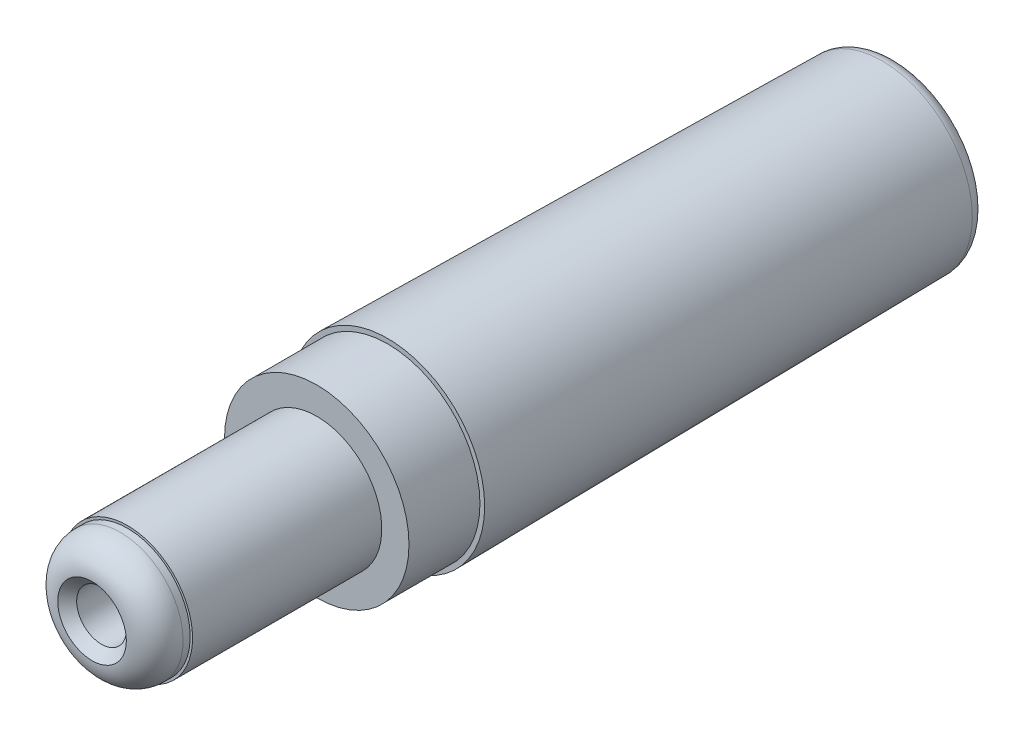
ISO-10303-21;
HEADER;
FILE_DESCRIPTION(('STEP AP214'),'2;1');
FILE_NAME('part.step','',(''),(''),'','','');
FILE_SCHEMA(('AUTOMOTIVE_DESIGN { 1 0 10303 214 1 1 1 1 }'));
ENDSEC;
DATA;
#1=APPLICATION_CONTEXT('core data for automotive mechanical design processes');
#2=APPLICATION_PROTOCOL_DEFINITION('international standard','automotive_design',2000,#1);
#3=PRODUCT_CONTEXT('',#1,'mechanical');
#4=PRODUCT('Part','Part','',(#3));
#5=PRODUCT_RELATED_PRODUCT_CATEGORY('part','',(#4));
#6=PRODUCT_DEFINITION_FORMATION('','',#4);
#7=PRODUCT_DEFINITION_CONTEXT('part definition',#1,'design');
#8=PRODUCT_DEFINITION('design','',#6,#7);
#9=PRODUCT_DEFINITION_SHAPE('','',#8);
#10=(LENGTH_UNIT() NAMED_UNIT(*) SI_UNIT(.MILLI.,.METRE.));
#11=(NAMED_UNIT(*) PLANE_ANGLE_UNIT() SI_UNIT($,.RADIAN.));
#12=(NAMED_UNIT(*) SI_UNIT($,.STERADIAN.) SOLID_ANGLE_UNIT());
#13=UNCERTAINTY_MEASURE_WITH_UNIT(LENGTH_MEASURE(1.E-05),#10,'distance_accuracy_value','');
#14=(GEOMETRIC_REPRESENTATION_CONTEXT(3) GLOBAL_UNCERTAINTY_ASSIGNED_CONTEXT((#13)) GLOBAL_UNIT_ASSIGNED_CONTEXT((#10,
#11,#12)) REPRESENTATION_CONTEXT('',''));
#15=CARTESIAN_POINT('',(0.,0.,0.));
#16=DIRECTION('',(0.,0.,1.));
#17=DIRECTION('',(1.,0.,0.));
#18=AXIS2_PLACEMENT_3D('',#15,#16,#17);
#19=CARTESIAN_POINT('',(0.,0.,-20.9));
#20=DIRECTION('',(0.,0.,1.));
#21=DIRECTION('',(1.,0.,0.));
#22=AXIS2_PLACEMENT_3D('',#19,#20,#21);
#23=TOROIDAL_SURFACE('',#22,3.20831368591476,0.599999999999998);
#24=CARTESIAN_POINT('',(0.,0.,-20.9083712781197));
#25=DIRECTION('',(0.,0.,1.));
#26=DIRECTION('',(1.,0.,0.));
#27=AXIS2_PLACEMENT_3D('',#24,#25,#26);
#28=CIRCLE('',#27,3.80825528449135);
#29=CARTESIAN_POINT('',(3.80825528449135,0.,-20.9083712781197));
#30=VERTEX_POINT('',#29);
#31=EDGE_CURVE('E39',#30,#30,#28,.T.);
#32=ORIENTED_EDGE('',*,*,#31,.F.);
#33=EDGE_LOOP('',(#32));
#34=FACE_BOUND('',#33,.T.);
#35=CARTESIAN_POINT('',(0.,0.,-21.5));
#36=DIRECTION('',(0.,0.,1.));
#37=DIRECTION('',(1.,0.,0.));
#38=AXIS2_PLACEMENT_3D('',#35,#36,#37);
#39=CIRCLE('',#38,3.20831368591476);
#40=CARTESIAN_POINT('',(3.20831368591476,0.,-21.5));
#41=VERTEX_POINT('',#40);
#42=EDGE_CURVE('E20',#41,#41,#39,.T.);
#43=ORIENTED_EDGE('',*,*,#42,.T.);
#44=EDGE_LOOP('',(#43));
#45=FACE_BOUND('',#44,.T.);
#46=ADVANCED_FACE('F13',(#34,#45),#23,.T.);
#47=CARTESIAN_POINT('',(0.,3.20831368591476,-21.5));
#48=DIRECTION('',(0.,0.,1.));
#49=DIRECTION('',(1.,0.,0.));
#50=AXIS2_PLACEMENT_3D('',#47,#48,#49);
#51=PLANE('',#50);
#52=ORIENTED_EDGE('',*,*,#42,.F.);
#53=EDGE_LOOP('',(#52));
#54=FACE_BOUND('',#53,.T.);
#55=CARTESIAN_POINT('',(0.,0.,-21.5));
#56=DIRECTION('',(0.,0.,1.));
#57=DIRECTION('',(1.,0.,0.));
#58=AXIS2_PLACEMENT_3D('',#55,#56,#57);
#59=CIRCLE('',#58,2.);
#60=CARTESIAN_POINT('',(2.,0.,-21.5));
#61=VERTEX_POINT('',#60);
#62=EDGE_CURVE('E24',#61,#61,#59,.T.);
#63=ORIENTED_EDGE('',*,*,#62,.T.);
#64=EDGE_LOOP('',(#63));
#65=FACE_BOUND('',#64,.T.);
#66=ADVANCED_FACE('F88',(#54,#65),#51,.F.);
#67=CARTESIAN_POINT('',(0.,0.,9.61752107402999));
#68=DIRECTION('',(0.,0.,1.));
#69=DIRECTION('',(1.,0.,0.));
#70=AXIS2_PLACEMENT_3D('',#67,#68,#69);
#71=CYLINDRICAL_SURFACE('',#70,2.);
#72=ORIENTED_EDGE('',*,*,#62,.F.);
#73=EDGE_LOOP('',(#72));
#74=FACE_BOUND('',#73,.T.);
#75=CARTESIAN_POINT('',(0.,0.,-19.6));
#76=DIRECTION('',(0.,0.,1.));
#77=DIRECTION('',(1.,0.,0.));
#78=AXIS2_PLACEMENT_3D('',#75,#76,#77);
#79=CIRCLE('',#78,2.);
#80=CARTESIAN_POINT('',(2.,0.,-19.6));
#81=VERTEX_POINT('',#80);
#82=EDGE_CURVE('E28',#81,#81,#79,.T.);
#83=ORIENTED_EDGE('',*,*,#82,.T.);
#84=EDGE_LOOP('',(#83));
#85=FACE_BOUND('',#84,.T.);
#86=ADVANCED_FACE('F94',(#74,#85),#71,.F.);
#87=CARTESIAN_POINT('',(0.,2.,-19.6));
#88=DIRECTION('',(0.,0.,-1.));
#89=DIRECTION('',(-1.,0.,0.));
#90=AXIS2_PLACEMENT_3D('',#87,#88,#89);
#91=PLANE('',#90);
#92=ORIENTED_EDGE('',*,*,#82,.F.);
#93=EDGE_LOOP('',(#92));
#94=FACE_BOUND('',#93,.T.);
#95=CARTESIAN_POINT('',(0.,0.,-19.6));
#96=DIRECTION('',(0.,0.,1.));
#97=DIRECTION('',(1.,0.,0.));
#98=AXIS2_PLACEMENT_3D('',#95,#96,#97);
#99=CIRCLE('',#98,2.9);
#100=CARTESIAN_POINT('',(2.9,0.,-19.6));
#101=VERTEX_POINT('',#100);
#102=EDGE_CURVE('E33',#101,#101,#99,.T.);
#103=ORIENTED_EDGE('',*,*,#102,.T.);
#104=EDGE_LOOP('',(#103));
#105=FACE_BOUND('',#104,.T.);
#106=ADVANCED_FACE('F101',(#94,#105),#91,.F.);
#107=CARTESIAN_POINT('',(0.,0.,9.61752107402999));
#108=DIRECTION('',(0.,0.,1.));
#109=DIRECTION('',(1.,0.,0.));
#110=AXIS2_PLACEMENT_3D('',#107,#108,#109);
#111=CYLINDRICAL_SURFACE('',#110,2.9);
#112=ORIENTED_EDGE('',*,*,#102,.F.);
#113=EDGE_LOOP('',(#112));
#114=FACE_BOUND('',#113,.T.);
#115=CARTESIAN_POINT('',(0.,0.,0.));
#116=DIRECTION('',(0.,0.,-1.));
#117=DIRECTION('',(-1.,0.,0.));
#118=AXIS2_PLACEMENT_3D('',#115,#116,#117);
#119=CIRCLE('',#118,2.9);
#120=CARTESIAN_POINT('',(-2.9,0.,0.));
#121=VERTEX_POINT('',#120);
#122=EDGE_CURVE('E42',#121,#121,#119,.F.);
#123=ORIENTED_EDGE('',*,*,#122,.T.);
#124=EDGE_LOOP('',(#123));
#125=FACE_BOUND('',#124,.T.);
#126=ADVANCED_FACE('F105',(#114,#125),#111,.F.);
#127=CARTESIAN_POINT('',(0.,2.9,0.));
#128=DIRECTION('',(0.,0.,-1.));
#129=DIRECTION('',(-1.,0.,0.));
#130=AXIS2_PLACEMENT_3D('',#127,#128,#129);
#131=PLANE('',#130);
#132=CARTESIAN_POINT('',(0.,0.,0.));
#133=DIRECTION('',(0.,0.,-1.));
#134=DIRECTION('',(-1.,0.,0.));
#135=AXIS2_PLACEMENT_3D('',#132,#133,#134);
#136=CIRCLE('',#135,3.9);
#137=CARTESIAN_POINT('',(-3.9,0.,0.));
#138=VERTEX_POINT('',#137);
#139=EDGE_CURVE('E45',#138,#138,#136,.T.);
#140=ORIENTED_EDGE('',*,*,#139,.T.);
#141=EDGE_LOOP('',(#140));
#142=FACE_BOUND('',#141,.T.);
#143=CARTESIAN_POINT('',(0.,0.,0.));
#144=DIRECTION('',(0.,0.,1.));
#145=DIRECTION('',(1.,0.,0.));
#146=AXIS2_PLACEMENT_3D('',#143,#144,#145);
#147=CIRCLE('',#146,4.1);
#148=CARTESIAN_POINT('',(4.1,0.,0.));
#149=VERTEX_POINT('',#148);
#150=EDGE_CURVE('E36',#149,#149,#147,.T.);
#151=ORIENTED_EDGE('',*,*,#150,.T.);
#152=EDGE_LOOP('',(#151));
#153=FACE_BOUND('',#152,.T.);
#154=ADVANCED_FACE('F109',(#142,#153),#131,.F.);
#155=CARTESIAN_POINT('',(0.,0.,-20.9083712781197));
#156=DIRECTION('',(0.,0.,1.));
#157=DIRECTION('',(1.,0.,0.));
#158=AXIS2_PLACEMENT_3D('',#155,#156,#157);
#159=CONICAL_SURFACE('',#158,3.80825528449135,0.0139525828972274);
#160=ORIENTED_EDGE('',*,*,#150,.F.);
#161=EDGE_LOOP('',(#160));
#162=FACE_BOUND('',#161,.T.);
#163=ORIENTED_EDGE('',*,*,#31,.T.);
#164=EDGE_LOOP('',(#163));
#165=FACE_BOUND('',#164,.T.);
#166=ADVANCED_FACE('F113',(#162,#165),#159,.T.);
#167=CARTESIAN_POINT('',(0.,0.,11.3));
#168=DIRECTION('',(0.,0.,-1.));
#169=DIRECTION('',(-1.,0.,0.));
#170=AXIS2_PLACEMENT_3D('',#167,#168,#169);
#171=TOROIDAL_SURFACE('',#170,1.45,1.2);
#172=CARTESIAN_POINT('',(0.,0.,12.5));
#173=DIRECTION('',(0.,0.,-1.));
#174=DIRECTION('',(-1.,0.,0.));
#175=AXIS2_PLACEMENT_3D('',#172,#173,#174);
#176=CIRCLE('',#175,1.44999999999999);
#177=CARTESIAN_POINT('',(-1.44999999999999,0.,12.5));
#178=VERTEX_POINT('',#177);
#179=EDGE_CURVE('E63',#178,#178,#176,.T.);
#180=ORIENTED_EDGE('',*,*,#179,.T.);
#181=EDGE_LOOP('',(#180));
#182=FACE_BOUND('',#181,.T.);
#183=CARTESIAN_POINT('',(0.,0.,11.3));
#184=DIRECTION('',(0.,0.,-1.));
#185=DIRECTION('',(-1.,0.,0.));
#186=AXIS2_PLACEMENT_3D('',#183,#184,#185);
#187=CIRCLE('',#186,2.65);
#188=CARTESIAN_POINT('',(-2.65,0.,11.3));
#189=VERTEX_POINT('',#188);
#190=EDGE_CURVE('E60',#189,#189,#187,.T.);
#191=ORIENTED_EDGE('',*,*,#190,.F.);
#192=EDGE_LOOP('',(#191));
#193=FACE_BOUND('',#192,.T.);
#194=ADVANCED_FACE('F116',(#182,#193),#171,.T.);
#195=CARTESIAN_POINT('',(0.,0.,0.));
#196=DIRECTION('',(0.,0.,-1.));
#197=DIRECTION('',(-1.,0.,0.));
#198=AXIS2_PLACEMENT_3D('',#195,#196,#197);
#199=CYLINDRICAL_SURFACE('',#198,2.65);
#200=ORIENTED_EDGE('',*,*,#190,.T.);
#201=EDGE_LOOP('',(#200));
#202=FACE_BOUND('',#201,.T.);
#203=CARTESIAN_POINT('',(0.,0.,11.));
#204=DIRECTION('',(0.,0.,-1.));
#205=DIRECTION('',(-1.,0.,0.));
#206=AXIS2_PLACEMENT_3D('',#203,#204,#205);
#207=CIRCLE('',#206,2.65);
#208=CARTESIAN_POINT('',(-2.65,0.,11.));
#209=VERTEX_POINT('',#208);
#210=EDGE_CURVE('E57',#209,#209,#207,.T.);
#211=ORIENTED_EDGE('',*,*,#210,.F.);
#212=EDGE_LOOP('',(#211));
#213=FACE_BOUND('',#212,.T.);
#214=ADVANCED_FACE('F133',(#202,#213),#199,.T.);
#215=CARTESIAN_POINT('',(0.,2.75,11.));
#216=DIRECTION('',(0.,0.,1.));
#217=DIRECTION('',(1.,0.,0.));
#218=AXIS2_PLACEMENT_3D('',#215,#216,#217);
#219=PLANE('',#218);
#220=ORIENTED_EDGE('',*,*,#210,.T.);
#221=EDGE_LOOP('',(#220));
#222=FACE_BOUND('',#221,.T.);
#223=CARTESIAN_POINT('',(0.,0.,11.));
#224=DIRECTION('',(0.,0.,-1.));
#225=DIRECTION('',(-1.,0.,0.));
#226=AXIS2_PLACEMENT_3D('',#223,#224,#225);
#227=CIRCLE('',#226,2.75);
#228=CARTESIAN_POINT('',(-2.75,0.,11.));
#229=VERTEX_POINT('',#228);
#230=EDGE_CURVE('E54',#229,#229,#227,.T.);
#231=ORIENTED_EDGE('',*,*,#230,.F.);
#232=EDGE_LOOP('',(#231));
#233=FACE_BOUND('',#232,.T.);
#234=ADVANCED_FACE('F129',(#222,#233),#219,.T.);
#235=CARTESIAN_POINT('',(0.,0.,0.));
#236=DIRECTION('',(0.,0.,-1.));
#237=DIRECTION('',(-1.,0.,0.));
#238=AXIS2_PLACEMENT_3D('',#235,#236,#237);
#239=CYLINDRICAL_SURFACE('',#238,2.75);
#240=ORIENTED_EDGE('',*,*,#230,.T.);
#241=EDGE_LOOP('',(#240));
#242=FACE_BOUND('',#241,.T.);
#243=CARTESIAN_POINT('',(0.,0.,3.));
#244=DIRECTION('',(0.,0.,-1.));
#245=DIRECTION('',(-1.,0.,0.));
#246=AXIS2_PLACEMENT_3D('',#243,#244,#245);
#247=CIRCLE('',#246,2.75);
#248=CARTESIAN_POINT('',(-2.75,0.,3.));
#249=VERTEX_POINT('',#248);
#250=EDGE_CURVE('E51',#249,#249,#247,.T.);
#251=ORIENTED_EDGE('',*,*,#250,.F.);
#252=EDGE_LOOP('',(#251));
#253=FACE_BOUND('',#252,.T.);
#254=ADVANCED_FACE('F125',(#242,#253),#239,.T.);
#255=CARTESIAN_POINT('',(0.,3.9,3.));
#256=DIRECTION('',(0.,0.,1.));
#257=DIRECTION('',(1.,0.,0.));
#258=AXIS2_PLACEMENT_3D('',#255,#256,#257);
#259=PLANE('',#258);
#260=ORIENTED_EDGE('',*,*,#250,.T.);
#261=EDGE_LOOP('',(#260));
#262=FACE_BOUND('',#261,.T.);
#263=CARTESIAN_POINT('',(0.,0.,3.));
#264=DIRECTION('',(0.,0.,-1.));
#265=DIRECTION('',(-1.,0.,0.));
#266=AXIS2_PLACEMENT_3D('',#263,#264,#265);
#267=CIRCLE('',#266,3.9);
#268=CARTESIAN_POINT('',(-3.9,0.,3.));
#269=VERTEX_POINT('',#268);
#270=EDGE_CURVE('E48',#269,#269,#267,.T.);
#271=ORIENTED_EDGE('',*,*,#270,.F.);
#272=EDGE_LOOP('',(#271));
#273=FACE_BOUND('',#272,.T.);
#274=ADVANCED_FACE('F121',(#262,#273),#259,.T.);
#275=CARTESIAN_POINT('',(0.,0.,0.));
#276=DIRECTION('',(0.,0.,-1.));
#277=DIRECTION('',(-1.,0.,0.));
#278=AXIS2_PLACEMENT_3D('',#275,#276,#277);
#279=CYLINDRICAL_SURFACE('',#278,3.9);
#280=ORIENTED_EDGE('',*,*,#270,.T.);
#281=EDGE_LOOP('',(#280));
#282=FACE_BOUND('',#281,.T.);
#283=ORIENTED_EDGE('',*,*,#139,.F.);
#284=EDGE_LOOP('',(#283));
#285=FACE_BOUND('',#284,.T.);
#286=ADVANCED_FACE('F83',(#282,#285),#279,.T.);
#287=CARTESIAN_POINT('',(0.,0.,0.));
#288=DIRECTION('',(0.,0.,-1.));
#289=DIRECTION('',(-1.,0.,0.));
#290=AXIS2_PLACEMENT_3D('',#287,#288,#289);
#291=PLANE('',#290);
#292=ORIENTED_EDGE('',*,*,#122,.F.);
#293=EDGE_LOOP('',(#292));
#294=FACE_BOUND('',#293,.T.);
#295=ADVANCED_FACE('F74',(#294),#291,.T.);
#296=CARTESIAN_POINT('',(0.,0.,2.5));
#297=DIRECTION('',(0.,0.,1.));
#298=DIRECTION('',(1.,0.,0.));
#299=AXIS2_PLACEMENT_3D('',#296,#297,#298);
#300=CYLINDRICAL_SURFACE('',#299,1.05);
#301=CARTESIAN_POINT('',(0.,0.,12.1));
#302=DIRECTION('',(0.,0.,1.));
#303=DIRECTION('',(1.,0.,0.));
#304=AXIS2_PLACEMENT_3D('',#301,#302,#303);
#305=CIRCLE('',#304,1.05);
#306=CARTESIAN_POINT('',(1.05,0.,12.1));
#307=VERTEX_POINT('',#306);
#308=EDGE_CURVE('E9',#307,#307,#305,.T.);
#309=ORIENTED_EDGE('',*,*,#308,.T.);
#310=EDGE_LOOP('',(#309));
#311=FACE_BOUND('',#310,.T.);
#312=CARTESIAN_POINT('',(0.,0.,2.5));
#313=DIRECTION('',(0.,0.,1.));
#314=DIRECTION('',(1.,0.,0.));
#315=AXIS2_PLACEMENT_3D('',#312,#313,#314);
#316=CIRCLE('',#315,1.05);
#317=CARTESIAN_POINT('',(1.05,0.,2.5));
#318=VERTEX_POINT('',#317);
#319=EDGE_CURVE('E66',#318,#318,#316,.T.);
#320=ORIENTED_EDGE('',*,*,#319,.F.);
#321=EDGE_LOOP('',(#320));
#322=FACE_BOUND('',#321,.T.);
#323=ADVANCED_FACE('F72',(#311,#322),#300,.F.);
#324=CARTESIAN_POINT('',(0.,0.,2.5));
#325=DIRECTION('',(0.,0.,1.));
#326=DIRECTION('',(1.,0.,0.));
#327=AXIS2_PLACEMENT_3D('',#324,#325,#326);
#328=PLANE('',#327);
#329=ORIENTED_EDGE('',*,*,#319,.T.);
#330=EDGE_LOOP('',(#329));
#331=FACE_BOUND('',#330,.T.);
#332=ADVANCED_FACE('F70',(#331),#328,.T.);
#333=CARTESIAN_POINT('',(0.,0.,12.1));
#334=DIRECTION('',(0.,0.,1.));
#335=DIRECTION('',(1.,0.,0.));
#336=AXIS2_PLACEMENT_3D('',#333,#334,#335);
#337=CONICAL_SURFACE('',#336,1.05,0.785398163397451);
#338=ORIENTED_EDGE('',*,*,#179,.F.);
#339=EDGE_LOOP('',(#338));
#340=FACE_BOUND('',#339,.T.);
#341=ORIENTED_EDGE('',*,*,#308,.F.);
#342=EDGE_LOOP('',(#341));
#343=FACE_BOUND('',#342,.T.);
#344=ADVANCED_FACE('F15',(#340,#343),#337,.F.);
#345=CLOSED_SHELL('',(#46,#66,#86,#106,#126,#154,#166,#194,#214,#234,#254,#274,#286,#295,#323,
#332,#344));
#346=MANIFOLD_SOLID_BREP('B1',#345);
#347=ADVANCED_BREP_SHAPE_REPRESENTATION('',(#18,#346),#14);
#348=SHAPE_DEFINITION_REPRESENTATION(#9,#347);
ENDSEC;
END-ISO-10303-21;
